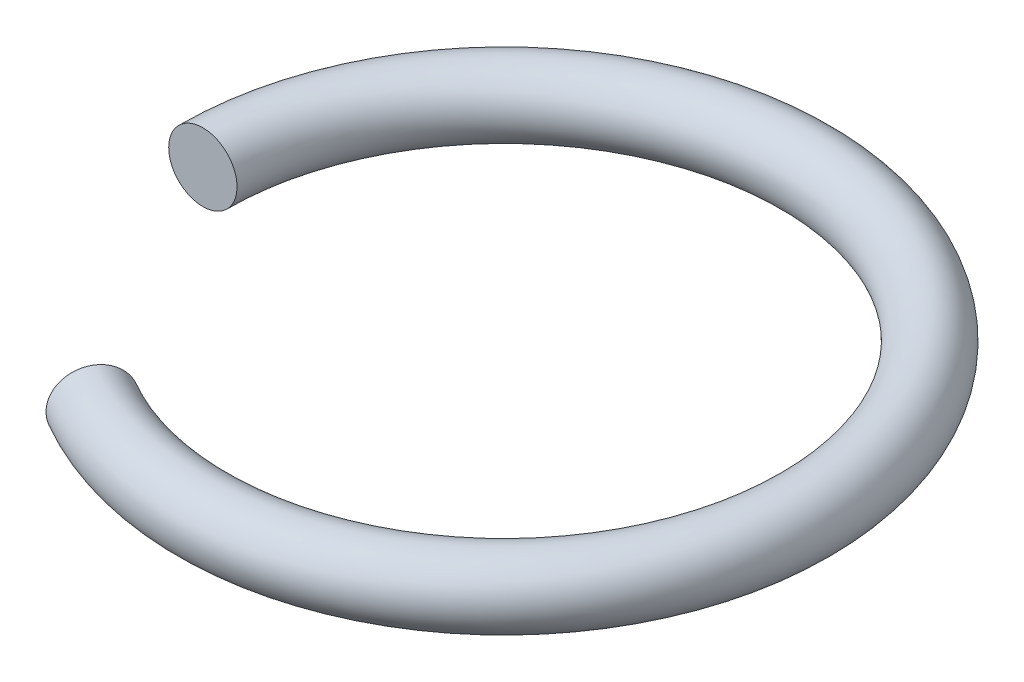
ISO-10303-21;
HEADER;
FILE_DESCRIPTION(('STEP AP214'),'2;1');
FILE_NAME('part.step','',(''),(''),'','','');
FILE_SCHEMA(('AUTOMOTIVE_DESIGN { 1 0 10303 214 1 1 1 1 }'));
ENDSEC;
DATA;
#1=APPLICATION_CONTEXT('core data for automotive mechanical design processes');
#2=APPLICATION_PROTOCOL_DEFINITION('international standard','automotive_design',2000,#1);
#3=PRODUCT_CONTEXT('',#1,'mechanical');
#4=PRODUCT('Part','Part','',(#3));
#5=PRODUCT_RELATED_PRODUCT_CATEGORY('part','',(#4));
#6=PRODUCT_DEFINITION_FORMATION('','',#4);
#7=PRODUCT_DEFINITION_CONTEXT('part definition',#1,'design');
#8=PRODUCT_DEFINITION('design','',#6,#7);
#9=PRODUCT_DEFINITION_SHAPE('','',#8);
#10=(LENGTH_UNIT() NAMED_UNIT(*) SI_UNIT(.MILLI.,.METRE.));
#11=(NAMED_UNIT(*) PLANE_ANGLE_UNIT() SI_UNIT($,.RADIAN.));
#12=(NAMED_UNIT(*) SI_UNIT($,.STERADIAN.) SOLID_ANGLE_UNIT());
#13=UNCERTAINTY_MEASURE_WITH_UNIT(LENGTH_MEASURE(1.E-05),#10,'distance_accuracy_value','');
#14=(GEOMETRIC_REPRESENTATION_CONTEXT(3) GLOBAL_UNCERTAINTY_ASSIGNED_CONTEXT((#13)) GLOBAL_UNIT_ASSIGNED_CONTEXT((#10,
#11,#12)) REPRESENTATION_CONTEXT('',''));
#15=CARTESIAN_POINT('',(0.,0.,0.));
#16=DIRECTION('',(0.,0.,1.));
#17=DIRECTION('',(1.,0.,0.));
#18=AXIS2_PLACEMENT_3D('',#15,#16,#17);
#19=CARTESIAN_POINT('',(0.,-18.525,0.));
#20=DIRECTION('',(0.,1.,0.));
#21=DIRECTION('',(0.,0.,1.));
#22=AXIS2_PLACEMENT_3D('',#19,#20,#21);
#23=TOROIDAL_SURFACE('',#22,6.83,0.775000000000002);
#24=CARTESIAN_POINT('',(-3.41500000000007,-18.525,5.91495350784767));
#25=DIRECTION('',(0.866025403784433,0.,0.50000000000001));
#26=DIRECTION('',(0.50000000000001,0.,-0.866025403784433));
#27=AXIS2_PLACEMENT_3D('',#24,#25,#26);
#28=CIRCLE('',#27,0.775000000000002);
#29=CARTESIAN_POINT('',(-3.80250000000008,-18.525,6.58612319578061));
#30=VERTEX_POINT('',#29);
#31=EDGE_CURVE('E10',#30,#30,#28,.T.);
#32=CARTESIAN_POINT('',(-6.83,-18.525,0.));
#33=DIRECTION('',(0.,0.,1.));
#34=DIRECTION('',(1.,0.,0.));
#35=AXIS2_PLACEMENT_3D('',#32,#33,#34);
#36=CIRCLE('',#35,0.775000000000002);
#37=CARTESIAN_POINT('',(-7.605,-18.525,0.));
#38=VERTEX_POINT('',#37);
#39=EDGE_CURVE('E33',#38,#38,#36,.T.);
#40=CARTESIAN_POINT('',(0.,-18.525,0.));
#41=DIRECTION('',(0.,1.,0.));
#42=DIRECTION('',(0.,0.,1.));
#43=AXIS2_PLACEMENT_3D('',#40,#41,#42);
#44=CIRCLE('',#43,7.605);
#45=EDGE_CURVE('',#30,#38,#44,.T.);
#46=ORIENTED_EDGE('',*,*,#31,.T.);
#47=ORIENTED_EDGE('',*,*,#39,.F.);
#48=ORIENTED_EDGE('',*,*,#45,.T.);
#49=ORIENTED_EDGE('',*,*,#45,.F.);
#50=EDGE_LOOP('',(#46,#48,#47,#49));
#51=FACE_BOUND('',#50,.T.);
#52=ADVANCED_FACE('F27',(#51),#23,.T.);
#53=CARTESIAN_POINT('',(-3.41500000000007,-18.525,5.91495350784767));
#54=DIRECTION('',(0.866025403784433,0.,0.50000000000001));
#55=DIRECTION('',(0.50000000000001,0.,-0.866025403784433));
#56=AXIS2_PLACEMENT_3D('',#53,#54,#55);
#57=PLANE('',#56);
#58=ORIENTED_EDGE('',*,*,#31,.F.);
#59=EDGE_LOOP('',(#58));
#60=FACE_BOUND('',#59,.T.);
#61=ADVANCED_FACE('F42',(#60),#57,.F.);
#62=CARTESIAN_POINT('',(-6.83,-18.525,0.));
#63=DIRECTION('',(0.,0.,1.));
#64=DIRECTION('',(1.,0.,0.));
#65=AXIS2_PLACEMENT_3D('',#62,#63,#64);
#66=PLANE('',#65);
#67=ORIENTED_EDGE('',*,*,#39,.T.);
#68=EDGE_LOOP('',(#67));
#69=FACE_BOUND('',#68,.T.);
#70=ADVANCED_FACE('F39',(#69),#66,.T.);
#71=CLOSED_SHELL('',(#52,#61,#70));
#72=MANIFOLD_SOLID_BREP('B2',#71);
#73=ADVANCED_BREP_SHAPE_REPRESENTATION('',(#18,#72),#14);
#74=SHAPE_DEFINITION_REPRESENTATION(#9,#73);
ENDSEC;
END-ISO-10303-21;
